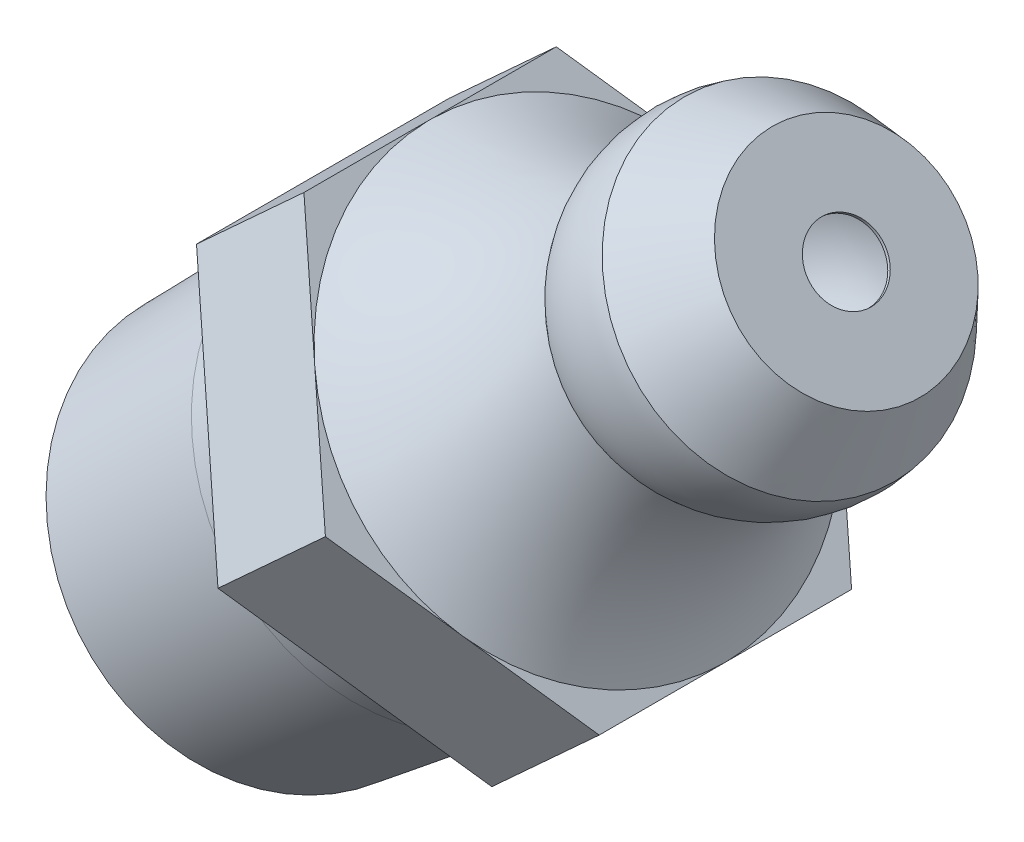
ISO-10303-21;
HEADER;
FILE_DESCRIPTION(('STEP AP214'),'2;1');
FILE_NAME('part.step','',(''),(''),'','','');
FILE_SCHEMA(('AUTOMOTIVE_DESIGN { 1 0 10303 214 1 1 1 1 }'));
ENDSEC;
DATA;
#1=APPLICATION_CONTEXT('core data for automotive mechanical design processes');
#2=APPLICATION_PROTOCOL_DEFINITION('international standard','automotive_design',2000,#1);
#3=PRODUCT_CONTEXT('',#1,'mechanical');
#4=PRODUCT('Part','Part','',(#3));
#5=PRODUCT_RELATED_PRODUCT_CATEGORY('part','',(#4));
#6=PRODUCT_DEFINITION_FORMATION('','',#4);
#7=PRODUCT_DEFINITION_CONTEXT('part definition',#1,'design');
#8=PRODUCT_DEFINITION('design','',#6,#7);
#9=PRODUCT_DEFINITION_SHAPE('','',#8);
#10=(LENGTH_UNIT() NAMED_UNIT(*) SI_UNIT(.MILLI.,.METRE.));
#11=(NAMED_UNIT(*) PLANE_ANGLE_UNIT() SI_UNIT($,.RADIAN.));
#12=(NAMED_UNIT(*) SI_UNIT($,.STERADIAN.) SOLID_ANGLE_UNIT());
#13=UNCERTAINTY_MEASURE_WITH_UNIT(LENGTH_MEASURE(1.E-05),#10,'distance_accuracy_value','');
#14=(GEOMETRIC_REPRESENTATION_CONTEXT(3) GLOBAL_UNCERTAINTY_ASSIGNED_CONTEXT((#13)) GLOBAL_UNIT_ASSIGNED_CONTEXT((#10,
#11,#12)) REPRESENTATION_CONTEXT('',''));
#15=CARTESIAN_POINT('',(0.,0.,0.));
#16=DIRECTION('',(0.,0.,1.));
#17=DIRECTION('',(1.,0.,0.));
#18=AXIS2_PLACEMENT_3D('',#15,#16,#17);
#19=CARTESIAN_POINT('',(136.211987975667,124.815286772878,-234.000002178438));
#20=DIRECTION('',(0.737277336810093,0.675590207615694,-1.17912735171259E-08));
#21=DIRECTION('',(0.675590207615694,-0.737277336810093,1.28679170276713E-08));
#22=AXIS2_PLACEMENT_3D('',#19,#20,#21);
#23=CONICAL_SURFACE('',#22,4.015,0.0599281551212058);
#24=CARTESIAN_POINT('',(137.87086198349,126.335364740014,-234.000002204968));
#25=DIRECTION('',(-0.737277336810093,-0.675590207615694,1.17912735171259E-08));
#26=DIRECTION('',(0.675590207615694,-0.737277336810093,1.28679170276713E-08));
#27=AXIS2_PLACEMENT_3D('',#24,#25,#26);
#28=CIRCLE('',#27,4.15);
#29=CARTESIAN_POINT('',(140.674561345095,123.275663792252,-234.000002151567));
#30=VERTEX_POINT('',#29);
#31=EDGE_CURVE('E11',#30,#30,#28,.T.);
#32=ORIENTED_EDGE('',*,*,#31,.T.);
#33=EDGE_LOOP('',(#32));
#34=FACE_BOUND('',#33,.T.);
#35=CARTESIAN_POINT('',(134.553113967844,123.295208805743,-234.000002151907));
#36=DIRECTION('',(0.737277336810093,0.675590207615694,-1.17912735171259E-08));
#37=DIRECTION('',(0.675590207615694,-0.737277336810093,1.28679170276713E-08));
#38=AXIS2_PLACEMENT_3D('',#35,#36,#37);
#39=CIRCLE('',#38,3.88);
#40=CARTESIAN_POINT('',(131.931823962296,126.155844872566,-234.000002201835));
#41=VERTEX_POINT('',#40);
#42=EDGE_CURVE('E27',#41,#41,#39,.T.);
#43=ORIENTED_EDGE('',*,*,#42,.T.);
#44=EDGE_LOOP('',(#43));
#45=FACE_BOUND('',#44,.T.);
#46=ADVANCED_FACE('F17',(#34,#45),#23,.T.);
#47=CARTESIAN_POINT('',(133.421061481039,122.25787382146,-234.000002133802));
#48=DIRECTION('',(0.737277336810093,0.675590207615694,-1.17912735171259E-08));
#49=DIRECTION('',(0.675590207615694,-0.737277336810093,1.28679170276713E-08));
#50=AXIS2_PLACEMENT_3D('',#47,#48,#49);
#51=CYLINDRICAL_SURFACE('',#50,4.15);
#52=ORIENTED_EDGE('',*,*,#31,.F.);
#53=EDGE_LOOP('',(#52));
#54=FACE_BOUND('',#53,.T.);
#55=CARTESIAN_POINT('',(138.6081393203,127.01095494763,-234.000002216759));
#56=DIRECTION('',(-0.737277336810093,-0.675590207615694,1.17912735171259E-08));
#57=DIRECTION('',(0.675590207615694,-0.737277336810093,1.28679170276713E-08));
#58=AXIS2_PLACEMENT_3D('',#55,#56,#57);
#59=CIRCLE('',#58,4.15);
#60=CARTESIAN_POINT('',(135.804439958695,130.070655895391,-234.000002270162));
#61=VERTEX_POINT('',#60);
#62=EDGE_CURVE('E340',#61,#61,#59,.T.);
#63=ORIENTED_EDGE('',*,*,#62,.T.);
#64=EDGE_LOOP('',(#63));
#65=FACE_BOUND('',#64,.T.);
#66=ADVANCED_FACE('F373',(#54,#65),#51,.T.);
#67=CARTESIAN_POINT('',(138.6081393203,127.01095494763,-234.000002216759));
#68=DIRECTION('',(0.737277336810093,0.675590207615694,-1.17912735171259E-08));
#69=DIRECTION('',(0.675590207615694,-0.737277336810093,1.28679170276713E-08));
#70=AXIS2_PLACEMENT_3D('',#67,#68,#69);
#71=PLANE('',#70);
#72=DIRECTION('',(0.585078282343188,-0.638500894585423,0.50000001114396));
#73=VECTOR('',#72,1.);
#74=CARTESIAN_POINT('',(136.328022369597,129.499266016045,-230.752406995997));
#75=LINE('',#74,#73);
#76=CARTESIAN_POINT('',(135.567983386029,130.32870300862,-231.401926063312));
#77=VERTEX_POINT('',#76);
#78=CARTESIAN_POINT('',(138.6081393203,127.010955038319,-228.803849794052));
#79=VERTEX_POINT('',#78);
#80=EDGE_CURVE('E169',#77,#79,#75,.T.);
#81=ORIENTED_EDGE('',*,*,#80,.F.);
#82=DIRECTION('',(0.,1.74532925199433E-08,1.));
#83=VECTOR('',#82,1.);
#84=CARTESIAN_POINT('',(135.567983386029,130.328702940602,-235.299040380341));
#85=LINE('',#84,#83);
#86=CARTESIAN_POINT('',(135.567983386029,130.32870291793,-236.598078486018));
#87=VERTEX_POINT('',#86);
#88=EDGE_CURVE('E167',#87,#77,#85,.T.);
#89=ORIENTED_EDGE('',*,*,#88,.F.);
#90=DIRECTION('',(-0.585078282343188,0.638500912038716,0.499999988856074));
#91=VECTOR('',#90,1.);
#92=CARTESIAN_POINT('',(137.848100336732,127.840391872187,-238.546635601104));
#93=LINE('',#92,#91);
#94=CARTESIAN_POINT('',(138.6081393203,127.01095485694,-239.196154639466));
#95=VERTEX_POINT('',#94);
#96=EDGE_CURVE('E196',#95,#87,#93,.T.);
#97=ORIENTED_EDGE('',*,*,#96,.F.);
#98=DIRECTION('',(-0.585078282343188,0.638500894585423,-0.50000001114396));
#99=VECTOR('',#98,1.);
#100=CARTESIAN_POINT('',(140.888256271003,124.522643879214,-237.247597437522));
#101=LINE('',#100,#99);
#102=CARTESIAN_POINT('',(141.648295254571,123.693206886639,-236.598078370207));
#103=VERTEX_POINT('',#102);
#104=EDGE_CURVE('E223',#103,#95,#101,.T.);
#105=ORIENTED_EDGE('',*,*,#104,.F.);
#106=DIRECTION('',(0.,-1.74532925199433E-08,-1.));
#107=VECTOR('',#106,1.);
#108=CARTESIAN_POINT('',(141.648295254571,123.693206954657,-232.700964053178));
#109=LINE('',#108,#107);
#110=CARTESIAN_POINT('',(141.648295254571,123.693206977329,-231.4019259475));
#111=VERTEX_POINT('',#110);
#112=EDGE_CURVE('E261',#111,#103,#109,.T.);
#113=ORIENTED_EDGE('',*,*,#112,.F.);
#114=DIRECTION('',(0.585078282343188,-0.638500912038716,-0.499999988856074));
#115=VECTOR('',#114,1.);
#116=CARTESIAN_POINT('',(139.368178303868,126.181518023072,-229.453368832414));
#117=LINE('',#116,#115);
#118=EDGE_CURVE('E311',#79,#111,#117,.T.);
#119=ORIENTED_EDGE('',*,*,#118,.F.);
#120=EDGE_LOOP('',(#81,#89,#97,#105,#113,#119));
#121=FACE_BOUND('',#120,.T.);
#122=ORIENTED_EDGE('',*,*,#62,.F.);
#123=EDGE_LOOP('',(#122));
#124=FACE_BOUND('',#123,.T.);
#125=ADVANCED_FACE('F379',(#121,#124),#71,.F.);
#126=CARTESIAN_POINT('',(128.101273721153,117.383186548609,-228.803849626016));
#127=DIRECTION('',(-0.337795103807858,0.368638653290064,-0.866025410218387));
#128=DIRECTION('',(-0.737277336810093,-0.675590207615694,1.17912735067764E-08));
#129=AXIS2_PLACEMENT_3D('',#126,#127,#128);
#130=PLANE('',#129);
#131=DIRECTION('',(0.737277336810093,0.675590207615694,-1.17912735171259E-08));
#132=VECTOR('',#131,1.);
#133=CARTESIAN_POINT('',(131.141429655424,114.065438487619,-231.401925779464));
#134=LINE('',#133,#132);
#135=CARTESIAN_POINT('',(143.860127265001,125.719977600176,-231.401925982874));
#136=VERTEX_POINT('',#135);
#137=EDGE_CURVE('E306',#111,#136,#134,.T.);
#138=ORIENTED_EDGE('',*,*,#137,.T.);
#139=DIRECTION('',(0.585078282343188,-0.638500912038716,-0.499999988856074));
#140=VECTOR('',#139,1.);
#141=CARTESIAN_POINT('',(141.580010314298,128.208288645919,-229.453368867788));
#142=LINE('',#141,#140);
#143=CARTESIAN_POINT('',(142.362404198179,127.354455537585,-230.121992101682));
#144=VERTEX_POINT('',#143);
#145=EDGE_CURVE('E88',#144,#136,#142,.T.);
#146=ORIENTED_EDGE('',*,*,#145,.F.);
#147=CARTESIAN_POINT('',(143.230065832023,125.900530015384,-231.0793138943));
#148=CARTESIAN_POINT('',(143.112530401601,126.177646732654,-230.915509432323));
#149=CARTESIAN_POINT('',(142.98457435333,126.4478982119,-230.75056269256));
#150=CARTESIAN_POINT('',(142.690945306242,126.947881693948,-230.423205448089));
#151=CARTESIAN_POINT('',(142.524519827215,127.17711749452,-230.260712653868));
#152=CARTESIAN_POINT('',(142.339840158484,127.378659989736,-230.102887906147));
#153=CARTESIAN_POINT('',(142.155160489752,127.580202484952,-229.945063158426));
#154=CARTESIAN_POINT('',(141.941301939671,127.765973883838,-229.782570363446));
#155=CARTESIAN_POINT('',(141.468812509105,128.102062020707,-229.455213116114));
#156=CARTESIAN_POINT('',(141.210741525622,128.253085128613,-229.29026637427));
#157=CARTESIAN_POINT('',(140.944923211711,128.394325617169,-229.126461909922));
#158=(BOUNDED_CURVE() B_SPLINE_CURVE(3,(#147,#148,#149,#150,#151,#152,#153,#154,#155,#156,#157),
.UNSPECIFIED.,.F.,.F.) B_SPLINE_CURVE_WITH_KNOTS((4,2,3,2,4),(-1.89389701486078,
-0.946948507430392,0.,0.946948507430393,1.89389701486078),
.UNSPECIFIED.) CURVE() GEOMETRIC_REPRESENTATION_ITEM() RATIONAL_B_SPLINE_CURVE((1.,1.,1.,1.,1.,
1.,1.,1.,1.,1.,1.)) REPRESENTATION_ITEM(''));
#159=CARTESIAN_POINT('',(142.324514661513,127.395804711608,-230.090056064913));
#160=VERTEX_POINT('',#159);
#161=EDGE_CURVE('E309',#144,#160,#158,.T.);
#162=ORIENTED_EDGE('',*,*,#161,.T.);
#163=DIRECTION('',(0.585078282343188,-0.638500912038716,-0.499999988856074));
#164=VECTOR('',#163,1.);
#165=CARTESIAN_POINT('',(141.580010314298,128.208288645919,-229.453368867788));
#166=LINE('',#165,#164);
#167=CARTESIAN_POINT('',(140.819971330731,129.037725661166,-228.803849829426));
#168=VERTEX_POINT('',#167);
#169=EDGE_CURVE('E99',#168,#160,#166,.T.);
#170=ORIENTED_EDGE('',*,*,#169,.F.);
#171=DIRECTION('',(0.737277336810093,0.675590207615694,-1.17912735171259E-08));
#172=VECTOR('',#171,1.);
#173=CARTESIAN_POINT('',(128.101273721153,117.383186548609,-228.803849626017));
#174=LINE('',#173,#172);
#175=EDGE_CURVE('E286',#79,#168,#174,.T.);
#176=ORIENTED_EDGE('',*,*,#175,.F.);
#177=ORIENTED_EDGE('',*,*,#118,.T.);
#178=EDGE_LOOP('',(#138,#146,#162,#170,#176,#177));
#179=FACE_BOUND('',#178,.T.);
#180=ADVANCED_FACE('F384',(#179),#130,.F.);
#181=CARTESIAN_POINT('',(125.061117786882,120.700934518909,-231.401925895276));
#182=DIRECTION('',(0.337795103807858,-0.368638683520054,-0.866025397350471));
#183=DIRECTION('',(-0.585078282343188,0.638500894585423,-0.50000001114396));
#184=AXIS2_PLACEMENT_3D('',#181,#182,#183);
#185=PLANE('',#184);
#186=ORIENTED_EDGE('',*,*,#175,.T.);
#187=DIRECTION('',(0.585078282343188,-0.638500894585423,0.50000001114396));
#188=VECTOR('',#187,1.);
#189=CARTESIAN_POINT('',(138.539854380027,131.526036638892,-230.752407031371));
#190=LINE('',#189,#188);
#191=CARTESIAN_POINT('',(139.316091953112,130.678381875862,-230.088814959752));
#192=VERTEX_POINT('',#191);
#193=EDGE_CURVE('E298',#192,#168,#190,.T.);
#194=ORIENTED_EDGE('',*,*,#193,.F.);
#195=CARTESIAN_POINT('',(140.189909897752,129.218278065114,-229.126461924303));
#196=CARTESIAN_POINT('',(140.07237446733,129.495394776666,-229.290266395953));
#197=CARTESIAN_POINT('',(139.94441841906,129.765646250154,-229.45521314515));
#198=CARTESIAN_POINT('',(139.650789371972,130.265629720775,-229.782570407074));
#199=CARTESIAN_POINT('',(139.484363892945,130.494865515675,-229.945063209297));
#200=CARTESIAN_POINT('',(139.299684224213,130.696408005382,-230.102887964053));
#201=CARTESIAN_POINT('',(139.115004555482,130.897950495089,-230.260712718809));
#202=CARTESIAN_POINT('',(138.901146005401,131.083721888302,-230.423205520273));
#203=CARTESIAN_POINT('',(138.428656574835,131.419810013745,-230.750562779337));
#204=CARTESIAN_POINT('',(138.170585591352,131.570833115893,-230.915509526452));
#205=CARTESIAN_POINT('',(137.904767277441,131.712073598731,-231.079313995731));
#206=(BOUNDED_CURVE() B_SPLINE_CURVE(3,(#195,#196,#197,#198,#199,#200,#201,#202,#203,#204,#205),
.UNSPECIFIED.,.F.,.F.) B_SPLINE_CURVE_WITH_KNOTS((4,2,3,2,4),(-1.89389701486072,
-0.946948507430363,0.,0.946948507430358,1.89389701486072),
.UNSPECIFIED.) CURVE() GEOMETRIC_REPRESENTATION_ITEM() RATIONAL_B_SPLINE_CURVE((1.,1.,1.,1.,1.,
1.,1.,1.,1.,1.,1.)) REPRESENTATION_ITEM(''));
#207=CARTESIAN_POINT('',(139.28064587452,130.717025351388,-230.119090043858));
#208=VERTEX_POINT('',#207);
#209=EDGE_CURVE('E284',#192,#208,#206,.T.);
#210=ORIENTED_EDGE('',*,*,#209,.T.);
#211=DIRECTION('',(0.585078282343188,-0.638500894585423,0.50000001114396));
#212=VECTOR('',#211,1.);
#213=CARTESIAN_POINT('',(138.539854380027,131.526036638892,-230.752407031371));
#214=LINE('',#213,#212);
#215=CARTESIAN_POINT('',(137.77981539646,132.355473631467,-231.401926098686));
#216=VERTEX_POINT('',#215);
#217=EDGE_CURVE('E158',#216,#208,#214,.T.);
#218=ORIENTED_EDGE('',*,*,#217,.F.);
#219=DIRECTION('',(0.737277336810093,0.675590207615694,-1.17912735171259E-08));
#220=VECTOR('',#219,1.);
#221=CARTESIAN_POINT('',(125.061117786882,120.700934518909,-231.401925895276));
#222=LINE('',#221,#220);
#223=EDGE_CURVE('E166',#77,#216,#222,.T.);
#224=ORIENTED_EDGE('',*,*,#223,.F.);
#225=ORIENTED_EDGE('',*,*,#80,.T.);
#226=EDGE_LOOP('',(#186,#194,#210,#218,#224,#225));
#227=FACE_BOUND('',#226,.T.);
#228=ADVANCED_FACE('F404',(#227),#185,.F.);
#229=CARTESIAN_POINT('',(125.061117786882,120.700934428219,-236.598078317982));
#230=DIRECTION('',(0.675590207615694,-0.737277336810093,1.28679170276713E-08));
#231=DIRECTION('',(0.737277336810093,0.675590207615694,-1.17912735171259E-08));
#232=AXIS2_PLACEMENT_3D('',#229,#230,#231);
#233=PLANE('',#232);
#234=ORIENTED_EDGE('',*,*,#223,.T.);
#235=DIRECTION('',(0.,1.74532925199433E-08,1.));
#236=VECTOR('',#235,1.);
#237=CARTESIAN_POINT('',(137.77981539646,132.35547356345,-235.299040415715));
#238=LINE('',#237,#236);
#239=CARTESIAN_POINT('',(137.779501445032,132.355185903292,-233.962767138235));
#240=VERTEX_POINT('',#239);
#241=EDGE_CURVE('E154',#240,#216,#238,.T.);
#242=ORIENTED_EDGE('',*,*,#241,.F.);
#243=CARTESIAN_POINT('',(137.527260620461,132.124049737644,-235.952854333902));
#244=CARTESIAN_POINT('',(137.601402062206,132.191987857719,-235.625245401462));
#245=CARTESIAN_POINT('',(137.666459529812,132.251602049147,-235.295351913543));
#246=CARTESIAN_POINT('',(137.755889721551,132.333549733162,-234.640637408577));
#247=CARTESIAN_POINT('',(137.779606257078,132.355281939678,-234.315651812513));
#248=CARTESIAN_POINT('',(137.779606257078,132.355281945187,-234.000002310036));
#249=CARTESIAN_POINT('',(137.779606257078,132.355281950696,-233.684352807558));
#250=CARTESIAN_POINT('',(137.755889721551,132.333549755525,-233.359367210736));
#251=CARTESIAN_POINT('',(137.666459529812,132.251602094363,-232.70465270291));
#252=CARTESIAN_POINT('',(137.601402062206,132.19198791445,-232.374759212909));
#253=CARTESIAN_POINT('',(137.527260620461,132.124049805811,-232.047150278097));
#254=(BOUNDED_CURVE() B_SPLINE_CURVE(3,(#243,#244,#245,#246,#247,#248,#249,#250,#251,#252,#253),
.UNSPECIFIED.,.F.,.F.) B_SPLINE_CURVE_WITH_KNOTS((4,2,3,2,4),(-1.89389701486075,
-0.946948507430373,0.,0.946948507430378,1.89389701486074),
.UNSPECIFIED.) CURVE() GEOMETRIC_REPRESENTATION_ITEM() RATIONAL_B_SPLINE_CURVE((1.,1.,1.,1.,1.,
1.,1.,1.,1.,1.,1.)) REPRESENTATION_ITEM(''));
#255=CARTESIAN_POINT('',(137.779606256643,132.355281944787,-234.000078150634));
#256=VERTEX_POINT('',#255);
#257=EDGE_CURVE('E146',#256,#240,#254,.T.);
#258=ORIENTED_EDGE('',*,*,#257,.F.);
#259=CARTESIAN_POINT('',(137.527260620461,132.124049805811,-232.047150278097));
#260=CARTESIAN_POINT('',(137.601402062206,132.19198791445,-232.374759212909));
#261=CARTESIAN_POINT('',(137.666459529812,132.251602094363,-232.70465270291));
#262=CARTESIAN_POINT('',(137.755889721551,132.333549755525,-233.359367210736));
#263=CARTESIAN_POINT('',(137.779606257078,132.355281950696,-233.684352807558));
#264=CARTESIAN_POINT('',(137.779606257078,132.355281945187,-234.000002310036));
#265=CARTESIAN_POINT('',(137.779606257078,132.355281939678,-234.315651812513));
#266=CARTESIAN_POINT('',(137.755889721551,132.333549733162,-234.640637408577));
#267=CARTESIAN_POINT('',(137.666459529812,132.251602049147,-235.295351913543));
#268=CARTESIAN_POINT('',(137.601402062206,132.191987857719,-235.625245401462));
#269=CARTESIAN_POINT('',(137.527260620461,132.124049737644,-235.952854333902));
#270=(BOUNDED_CURVE() B_SPLINE_CURVE(3,(#259,#260,#261,#262,#263,#264,#265,#266,#267,#268,#269),
.UNSPECIFIED.,.F.,.F.) B_SPLINE_CURVE_WITH_KNOTS((4,2,3,2,4),(-1.89389701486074,
-0.946948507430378,0.,0.946948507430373,1.89389701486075),
.UNSPECIFIED.) CURVE() GEOMETRIC_REPRESENTATION_ITEM() RATIONAL_B_SPLINE_CURVE((1.,1.,1.,1.,1.,
1.,1.,1.,1.,1.,1.)) REPRESENTATION_ITEM(''));
#271=CARTESIAN_POINT('',(137.780127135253,132.355133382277,-234.03723940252));
#272=VERTEX_POINT('',#271);
#273=EDGE_CURVE('E151',#256,#272,#270,.T.);
#274=ORIENTED_EDGE('',*,*,#273,.T.);
#275=DIRECTION('',(0.,1.74532925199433E-08,1.));
#276=VECTOR('',#275,1.);
#277=CARTESIAN_POINT('',(137.77981539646,132.35547356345,-235.299040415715));
#278=LINE('',#277,#276);
#279=CARTESIAN_POINT('',(137.77981539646,132.355473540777,-236.598078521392));
#280=VERTEX_POINT('',#279);
#281=EDGE_CURVE('E212',#280,#272,#278,.T.);
#282=ORIENTED_EDGE('',*,*,#281,.F.);
#283=DIRECTION('',(0.737277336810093,0.675590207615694,-1.17912735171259E-08));
#284=VECTOR('',#283,1.);
#285=CARTESIAN_POINT('',(125.061117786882,120.700934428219,-236.598078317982));
#286=LINE('',#285,#284);
#287=EDGE_CURVE('E171',#87,#280,#286,.T.);
#288=ORIENTED_EDGE('',*,*,#287,.F.);
#289=ORIENTED_EDGE('',*,*,#88,.T.);
#290=EDGE_LOOP('',(#234,#242,#258,#274,#282,#288,#289));
#291=FACE_BOUND('',#290,.T.);
#292=ADVANCED_FACE('F149',(#291),#233,.F.);
#293=CARTESIAN_POINT('',(128.101273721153,117.383186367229,-239.19615447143));
#294=DIRECTION('',(0.337795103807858,-0.368638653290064,0.866025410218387));
#295=DIRECTION('',(0.737277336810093,0.675590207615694,-1.17912735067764E-08));
#296=AXIS2_PLACEMENT_3D('',#293,#294,#295);
#297=PLANE('',#296);
#298=ORIENTED_EDGE('',*,*,#287,.T.);
#299=DIRECTION('',(-0.585078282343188,0.638500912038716,0.499999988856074));
#300=VECTOR('',#299,1.);
#301=CARTESIAN_POINT('',(140.059932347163,129.867162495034,-238.546635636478));
#302=LINE('',#301,#300);
#303=CARTESIAN_POINT('',(139.277219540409,130.720702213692,-237.878012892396));
#304=VERTEX_POINT('',#303);
#305=EDGE_CURVE('E186',#304,#280,#302,.T.);
#306=ORIENTED_EDGE('',*,*,#305,.F.);
#307=CARTESIAN_POINT('',(137.90476727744,131.71207349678,-236.920690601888));
#308=CARTESIAN_POINT('',(138.170585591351,131.570833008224,-237.084495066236));
#309=CARTESIAN_POINT('',(138.428656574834,131.419809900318,-237.24944180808));
#310=CARTESIAN_POINT('',(138.901146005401,131.083721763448,-237.576799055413));
#311=CARTESIAN_POINT('',(139.115004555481,130.897950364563,-237.739291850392));
#312=CARTESIAN_POINT('',(139.299684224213,130.696407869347,-237.897116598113));
#313=CARTESIAN_POINT('',(139.484363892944,130.494865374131,-238.054941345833));
#314=CARTESIAN_POINT('',(139.650789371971,130.265629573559,-238.217434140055));
#315=CARTESIAN_POINT('',(139.944418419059,129.765646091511,-238.544791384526));
#316=CARTESIAN_POINT('',(140.07237446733,129.495394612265,-238.709738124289));
#317=CARTESIAN_POINT('',(140.189909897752,129.218277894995,-238.873542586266));
#318=(BOUNDED_CURVE() B_SPLINE_CURVE(3,(#307,#308,#309,#310,#311,#312,#313,#314,#315,#316,#317),
.UNSPECIFIED.,.F.,.F.) B_SPLINE_CURVE_WITH_KNOTS((4,2,3,2,4),(-1.89389701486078,
-0.946948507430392,0.,0.946948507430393,1.89389701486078),
.UNSPECIFIED.) CURVE() GEOMETRIC_REPRESENTATION_ITEM() RATIONAL_B_SPLINE_CURVE((1.,1.,1.,1.,1.,
1.,1.,1.,1.,1.,1.)) REPRESENTATION_ITEM(''));
#319=CARTESIAN_POINT('',(139.3160930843,130.678380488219,-237.911190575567));
#320=VERTEX_POINT('',#319);
#321=EDGE_CURVE('E193',#304,#320,#318,.T.);
#322=ORIENTED_EDGE('',*,*,#321,.T.);
#323=DIRECTION('',(-0.585078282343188,0.638500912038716,0.499999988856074));
#324=VECTOR('',#323,1.);
#325=CARTESIAN_POINT('',(140.059932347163,129.867162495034,-238.546635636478));
#326=LINE('',#325,#324);
#327=CARTESIAN_POINT('',(140.81997133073,129.037725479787,-239.19615467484));
#328=VERTEX_POINT('',#327);
#329=EDGE_CURVE('E185',#328,#320,#326,.T.);
#330=ORIENTED_EDGE('',*,*,#329,.F.);
#331=DIRECTION('',(0.737277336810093,0.675590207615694,-1.17912735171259E-08));
#332=VECTOR('',#331,1.);
#333=CARTESIAN_POINT('',(128.101273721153,117.383186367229,-239.19615447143));
#334=LINE('',#333,#332);
#335=EDGE_CURVE('E222',#95,#328,#334,.T.);
#336=ORIENTED_EDGE('',*,*,#335,.F.);
#337=ORIENTED_EDGE('',*,*,#96,.T.);
#338=EDGE_LOOP('',(#298,#306,#322,#330,#336,#337));
#339=FACE_BOUND('',#338,.T.);
#340=ADVANCED_FACE('F351',(#339),#297,.F.);
#341=CARTESIAN_POINT('',(131.141429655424,114.065438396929,-236.59807820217));
#342=DIRECTION('',(-0.337795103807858,0.368638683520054,0.86602539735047));
#343=DIRECTION('',(0.737277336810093,0.675590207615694,-1.17912735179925E-08));
#344=AXIS2_PLACEMENT_3D('',#341,#342,#343);
#345=PLANE('',#344);
#346=ORIENTED_EDGE('',*,*,#335,.T.);
#347=DIRECTION('',(-0.585078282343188,0.638500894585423,-0.50000001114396));
#348=VECTOR('',#347,1.);
#349=CARTESIAN_POINT('',(143.100088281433,126.549414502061,-237.247597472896));
#350=LINE('',#349,#348);
#351=CARTESIAN_POINT('',(142.323581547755,127.39682289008,-237.91118965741));
#352=VERTEX_POINT('',#351);
#353=EDGE_CURVE('E190',#352,#328,#350,.T.);
#354=ORIENTED_EDGE('',*,*,#353,.F.);
#355=CARTESIAN_POINT('',(140.944923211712,128.394325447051,-238.873542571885));
#356=CARTESIAN_POINT('',(141.210741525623,128.253084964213,-238.709738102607));
#357=CARTESIAN_POINT('',(141.468812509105,128.102061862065,-238.544791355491));
#358=CARTESIAN_POINT('',(141.941301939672,127.765973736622,-238.217434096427));
#359=CARTESIAN_POINT('',(142.155160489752,127.580202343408,-238.054941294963));
#360=CARTESIAN_POINT('',(142.339840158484,127.378659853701,-237.897116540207));
#361=CARTESIAN_POINT('',(142.524519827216,127.177117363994,-237.739291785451));
#362=CARTESIAN_POINT('',(142.690945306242,126.947881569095,-237.576798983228));
#363=CARTESIAN_POINT('',(142.98457435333,126.447898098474,-237.249441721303));
#364=CARTESIAN_POINT('',(143.112530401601,126.177646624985,-237.084494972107));
#365=CARTESIAN_POINT('',(143.230065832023,125.900529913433,-236.920690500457));
#366=(BOUNDED_CURVE() B_SPLINE_CURVE(3,(#355,#356,#357,#358,#359,#360,#361,#362,#363,#364,#365),
.UNSPECIFIED.,.F.,.F.) B_SPLINE_CURVE_WITH_KNOTS((4,2,3,2,4),(-1.89389701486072,
-0.946948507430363,0.,0.946948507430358,1.89389701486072),
.UNSPECIFIED.) CURVE() GEOMETRIC_REPRESENTATION_ITEM() RATIONAL_B_SPLINE_CURVE((1.,1.,1.,1.,1.,
1.,1.,1.,1.,1.,1.)) REPRESENTATION_ITEM(''));
#367=CARTESIAN_POINT('',(142.36245675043,127.353749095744,-237.877691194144));
#368=VERTEX_POINT('',#367);
#369=EDGE_CURVE('E219',#352,#368,#366,.T.);
#370=ORIENTED_EDGE('',*,*,#369,.T.);
#371=DIRECTION('',(-0.585078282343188,0.638500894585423,-0.50000001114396));
#372=VECTOR('',#371,1.);
#373=CARTESIAN_POINT('',(143.100088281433,126.549414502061,-237.247597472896));
#374=LINE('',#373,#372);
#375=CARTESIAN_POINT('',(143.860127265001,125.719977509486,-236.598078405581));
#376=VERTEX_POINT('',#375);
#377=EDGE_CURVE('E207',#376,#368,#374,.T.);
#378=ORIENTED_EDGE('',*,*,#377,.F.);
#379=DIRECTION('',(0.737277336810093,0.675590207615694,-1.17912735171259E-08));
#380=VECTOR('',#379,1.);
#381=CARTESIAN_POINT('',(131.141429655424,114.065438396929,-236.59807820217));
#382=LINE('',#381,#380);
#383=EDGE_CURVE('E247',#103,#376,#382,.T.);
#384=ORIENTED_EDGE('',*,*,#383,.F.);
#385=ORIENTED_EDGE('',*,*,#104,.T.);
#386=EDGE_LOOP('',(#346,#354,#370,#378,#384,#385));
#387=FACE_BOUND('',#386,.T.);
#388=ADVANCED_FACE('F386',(#387),#345,.F.);
#389=CARTESIAN_POINT('',(131.141429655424,114.065438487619,-231.401925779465));
#390=DIRECTION('',(-0.675590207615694,0.737277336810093,-1.28679170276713E-08));
#391=DIRECTION('',(0.,1.74532925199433E-08,1.));
#392=AXIS2_PLACEMENT_3D('',#389,#390,#391);
#393=PLANE('',#392);
#394=ORIENTED_EDGE('',*,*,#383,.T.);
#395=DIRECTION('',(0.,-1.74532925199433E-08,-1.));
#396=VECTOR('',#395,1.);
#397=CARTESIAN_POINT('',(143.860127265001,125.719977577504,-232.700964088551));
#398=LINE('',#397,#396);
#399=CARTESIAN_POINT('',(143.860127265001,125.719977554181,-234.037240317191));
#400=VERTEX_POINT('',#399);
#401=EDGE_CURVE('E216',#400,#376,#398,.T.);
#402=ORIENTED_EDGE('',*,*,#401,.F.);
#403=CARTESIAN_POINT('',(143.607572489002,125.488553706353,-235.952854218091));
#404=CARTESIAN_POINT('',(143.681713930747,125.556491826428,-235.62524528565));
#405=CARTESIAN_POINT('',(143.746771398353,125.616106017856,-235.295351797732));
#406=CARTESIAN_POINT('',(143.836201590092,125.698053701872,-234.640637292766));
#407=CARTESIAN_POINT('',(143.859918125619,125.719785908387,-234.315651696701));
#408=CARTESIAN_POINT('',(143.859918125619,125.719785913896,-234.000002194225));
#409=CARTESIAN_POINT('',(143.859918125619,125.719785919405,-233.684352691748));
#410=CARTESIAN_POINT('',(143.836201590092,125.698053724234,-233.359367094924));
#411=CARTESIAN_POINT('',(143.746771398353,125.616106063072,-232.704652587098));
#412=CARTESIAN_POINT('',(143.681713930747,125.55649188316,-232.374759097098));
#413=CARTESIAN_POINT('',(143.607572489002,125.48855377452,-232.047150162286));
#414=(BOUNDED_CURVE() B_SPLINE_CURVE(3,(#403,#404,#405,#406,#407,#408,#409,#410,#411,#412,#413),
.UNSPECIFIED.,.F.,.F.) B_SPLINE_CURVE_WITH_KNOTS((4,2,3,2,4),(-1.89389701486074,
-0.946948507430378,0.,0.946948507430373,1.89389701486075),
.UNSPECIFIED.) CURVE() GEOMETRIC_REPRESENTATION_ITEM() RATIONAL_B_SPLINE_CURVE((1.,1.,1.,1.,1.,
1.,1.,1.,1.,1.,1.)) REPRESENTATION_ITEM(''));
#415=CARTESIAN_POINT('',(143.85991812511,125.719785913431,-233.999920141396));
#416=VERTEX_POINT('',#415);
#417=EDGE_CURVE('E245',#400,#416,#414,.T.);
#418=ORIENTED_EDGE('',*,*,#417,.T.);
#419=CARTESIAN_POINT('',(143.607572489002,125.488553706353,-235.952854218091));
#420=CARTESIAN_POINT('',(143.681713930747,125.556491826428,-235.62524528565));
#421=CARTESIAN_POINT('',(143.746771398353,125.616106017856,-235.295351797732));
#422=CARTESIAN_POINT('',(143.836201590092,125.698053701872,-234.640637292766));
#423=CARTESIAN_POINT('',(143.859918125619,125.719785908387,-234.315651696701));
#424=CARTESIAN_POINT('',(143.859918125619,125.719785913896,-234.000002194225));
#425=CARTESIAN_POINT('',(143.859918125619,125.719785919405,-233.684352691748));
#426=CARTESIAN_POINT('',(143.836201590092,125.698053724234,-233.359367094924));
#427=CARTESIAN_POINT('',(143.746771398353,125.616106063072,-232.704652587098));
#428=CARTESIAN_POINT('',(143.681713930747,125.55649188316,-232.374759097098));
#429=CARTESIAN_POINT('',(143.607572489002,125.48855377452,-232.047150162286));
#430=(BOUNDED_CURVE() B_SPLINE_CURVE(3,(#419,#420,#421,#422,#423,#424,#425,#426,#427,#428,#429),
.UNSPECIFIED.,.F.,.F.) B_SPLINE_CURVE_WITH_KNOTS((4,2,3,2,4),(-1.89389701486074,
-0.946948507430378,0.,0.946948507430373,1.89389701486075),
.UNSPECIFIED.) CURVE() GEOMETRIC_REPRESENTATION_ITEM() RATIONAL_B_SPLINE_CURVE((1.,1.,1.,1.,1.,
1.,1.,1.,1.,1.,1.)) REPRESENTATION_ITEM(''));
#431=CARTESIAN_POINT('',(143.859813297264,125.719689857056,-233.962764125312));
#432=VERTEX_POINT('',#431);
#433=EDGE_CURVE('E248',#416,#432,#430,.T.);
#434=ORIENTED_EDGE('',*,*,#433,.T.);
#435=DIRECTION('',(0.,-1.74532925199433E-08,-1.));
#436=VECTOR('',#435,1.);
#437=CARTESIAN_POINT('',(143.860127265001,125.719977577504,-232.700964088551));
#438=LINE('',#437,#436);
#439=EDGE_CURVE('E234',#136,#432,#438,.T.);
#440=ORIENTED_EDGE('',*,*,#439,.F.);
#441=ORIENTED_EDGE('',*,*,#137,.F.);
#442=ORIENTED_EDGE('',*,*,#112,.T.);
#443=EDGE_LOOP('',(#394,#402,#418,#434,#440,#441,#442));
#444=FACE_BOUND('',#443,.T.);
#445=ADVANCED_FACE('F388',(#444),#393,.F.);
#446=CARTESIAN_POINT('',(140.81997133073,129.037725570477,-234.000002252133));
#447=DIRECTION('',(0.737277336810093,0.675590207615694,-1.17912735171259E-08));
#448=DIRECTION('',(0.675590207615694,-0.737277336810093,1.28679170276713E-08));
#449=AXIS2_PLACEMENT_3D('',#446,#447,#448);
#450=PLANE('',#449);
#451=CARTESIAN_POINT('',(140.81997133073,129.037725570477,-234.000002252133));
#452=DIRECTION('',(0.737277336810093,0.675590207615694,-1.17912735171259E-08));
#453=DIRECTION('',(0.,-1.74532925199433E-08,-1.));
#454=AXIS2_PLACEMENT_3D('',#451,#452,#453);
#455=CIRCLE('',#454,4.49969264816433);
#456=EDGE_CURVE('E295',#192,#160,#455,.T.);
#457=ORIENTED_EDGE('',*,*,#456,.F.);
#458=ORIENTED_EDGE('',*,*,#193,.T.);
#459=ORIENTED_EDGE('',*,*,#169,.T.);
#460=EDGE_LOOP('',(#457,#458,#459));
#461=FACE_BOUND('',#460,.T.);
#462=ADVANCED_FACE('F390',(#461),#450,.T.);
#463=CARTESIAN_POINT('',(140.81997133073,129.037725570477,-234.000002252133));
#464=DIRECTION('',(0.737277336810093,0.675590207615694,-1.17912735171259E-08));
#465=DIRECTION('',(0.675590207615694,-0.737277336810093,1.28679170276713E-08));
#466=AXIS2_PLACEMENT_3D('',#463,#464,#465);
#467=PLANE('',#466);
#468=CARTESIAN_POINT('',(140.81997133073,129.037725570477,-234.000002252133));
#469=DIRECTION('',(0.737277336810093,0.675590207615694,-1.17912735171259E-08));
#470=DIRECTION('',(0.,-1.74532925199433E-08,-1.));
#471=AXIS2_PLACEMENT_3D('',#468,#469,#470);
#472=CIRCLE('',#471,4.49969264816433);
#473=EDGE_CURVE('E321',#144,#432,#472,.T.);
#474=ORIENTED_EDGE('',*,*,#473,.F.);
#475=ORIENTED_EDGE('',*,*,#145,.T.);
#476=ORIENTED_EDGE('',*,*,#439,.T.);
#477=EDGE_LOOP('',(#474,#475,#476));
#478=FACE_BOUND('',#477,.T.);
#479=ADVANCED_FACE('F392',(#478),#467,.T.);
#480=CARTESIAN_POINT('',(140.81997133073,129.037725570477,-234.000002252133));
#481=DIRECTION('',(0.737277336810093,0.675590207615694,-1.17912735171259E-08));
#482=DIRECTION('',(0.675590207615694,-0.737277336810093,1.28679170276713E-08));
#483=AXIS2_PLACEMENT_3D('',#480,#481,#482);
#484=PLANE('',#483);
#485=CARTESIAN_POINT('',(140.81997133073,129.037725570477,-234.000002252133));
#486=DIRECTION('',(-0.737277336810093,-0.675590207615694,1.17912735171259E-08));
#487=DIRECTION('',(0.,-1.74532925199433E-08,-1.));
#488=AXIS2_PLACEMENT_3D('',#485,#486,#487);
#489=CIRCLE('',#488,4.49969264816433);
#490=EDGE_CURVE('E228',#368,#400,#489,.T.);
#491=ORIENTED_EDGE('',*,*,#490,.T.);
#492=ORIENTED_EDGE('',*,*,#401,.T.);
#493=ORIENTED_EDGE('',*,*,#377,.T.);
#494=EDGE_LOOP('',(#491,#492,#493));
#495=FACE_BOUND('',#494,.T.);
#496=ADVANCED_FACE('F367',(#495),#484,.T.);
#497=CARTESIAN_POINT('',(140.81997133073,129.037725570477,-234.000002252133));
#498=DIRECTION('',(0.737277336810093,0.675590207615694,-1.17912735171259E-08));
#499=DIRECTION('',(0.675590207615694,-0.737277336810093,1.28679170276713E-08));
#500=AXIS2_PLACEMENT_3D('',#497,#498,#499);
#501=PLANE('',#500);
#502=CARTESIAN_POINT('',(140.81997133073,129.037725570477,-234.000002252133));
#503=DIRECTION('',(-0.737277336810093,-0.675590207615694,1.17912735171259E-08));
#504=DIRECTION('',(0.,-1.74532925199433E-08,-1.));
#505=AXIS2_PLACEMENT_3D('',#502,#503,#504);
#506=CIRCLE('',#505,4.49969264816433);
#507=EDGE_CURVE('E201',#320,#352,#506,.T.);
#508=ORIENTED_EDGE('',*,*,#507,.T.);
#509=ORIENTED_EDGE('',*,*,#353,.T.);
#510=ORIENTED_EDGE('',*,*,#329,.T.);
#511=EDGE_LOOP('',(#508,#509,#510));
#512=FACE_BOUND('',#511,.T.);
#513=ADVANCED_FACE('F359',(#512),#501,.T.);
#514=CARTESIAN_POINT('',(140.81997133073,129.037725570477,-234.000002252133));
#515=DIRECTION('',(0.737277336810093,0.675590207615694,-1.17912735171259E-08));
#516=DIRECTION('',(0.675590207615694,-0.737277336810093,1.28679170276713E-08));
#517=AXIS2_PLACEMENT_3D('',#514,#515,#516);
#518=PLANE('',#517);
#519=CARTESIAN_POINT('',(140.81997133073,129.037725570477,-234.000002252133));
#520=DIRECTION('',(-0.737277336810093,-0.675590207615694,1.17912735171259E-08));
#521=DIRECTION('',(0.,-1.74532925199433E-08,-1.));
#522=AXIS2_PLACEMENT_3D('',#519,#520,#521);
#523=CIRCLE('',#522,4.49969264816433);
#524=EDGE_CURVE('E165',#272,#304,#523,.T.);
#525=ORIENTED_EDGE('',*,*,#524,.T.);
#526=ORIENTED_EDGE('',*,*,#305,.T.);
#527=ORIENTED_EDGE('',*,*,#281,.T.);
#528=EDGE_LOOP('',(#525,#526,#527));
#529=FACE_BOUND('',#528,.T.);
#530=ADVANCED_FACE('F356',(#529),#518,.T.);
#531=CARTESIAN_POINT('',(140.81997133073,129.037725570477,-234.000002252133));
#532=DIRECTION('',(0.737277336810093,0.675590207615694,-1.17912735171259E-08));
#533=DIRECTION('',(0.675590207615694,-0.737277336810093,1.28679170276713E-08));
#534=AXIS2_PLACEMENT_3D('',#531,#532,#533);
#535=PLANE('',#534);
#536=CARTESIAN_POINT('',(140.81997133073,129.037725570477,-234.000002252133));
#537=DIRECTION('',(0.737277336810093,0.675590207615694,-1.17912735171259E-08));
#538=DIRECTION('',(0.,-1.74532925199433E-08,-1.));
#539=AXIS2_PLACEMENT_3D('',#536,#537,#538);
#540=CIRCLE('',#539,4.49969264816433);
#541=EDGE_CURVE('E159',#240,#208,#540,.T.);
#542=ORIENTED_EDGE('',*,*,#541,.F.);
#543=ORIENTED_EDGE('',*,*,#241,.T.);
#544=ORIENTED_EDGE('',*,*,#217,.T.);
#545=EDGE_LOOP('',(#542,#543,#544));
#546=FACE_BOUND('',#545,.T.);
#547=ADVANCED_FACE('F358',(#546),#535,.T.);
#548=CARTESIAN_POINT('',(144.070627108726,132.016402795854,-234.000002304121));
#549=DIRECTION('',(0.737277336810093,0.675590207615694,-1.17912735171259E-08));
#550=DIRECTION('',(0.675590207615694,-0.737277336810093,1.28679170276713E-08));
#551=AXIS2_PLACEMENT_3D('',#548,#549,#550);
#552=TOROIDAL_SURFACE('',#551,8.569178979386,6.);
#553=ORIENTED_EDGE('',*,*,#273,.F.);
#554=ORIENTED_EDGE('',*,*,#257,.T.);
#555=ORIENTED_EDGE('',*,*,#541,.T.);
#556=ORIENTED_EDGE('',*,*,#209,.F.);
#557=ORIENTED_EDGE('',*,*,#456,.T.);
#558=ORIENTED_EDGE('',*,*,#161,.F.);
#559=ORIENTED_EDGE('',*,*,#473,.T.);
#560=ORIENTED_EDGE('',*,*,#433,.F.);
#561=ORIENTED_EDGE('',*,*,#417,.F.);
#562=ORIENTED_EDGE('',*,*,#490,.F.);
#563=ORIENTED_EDGE('',*,*,#369,.F.);
#564=ORIENTED_EDGE('',*,*,#507,.F.);
#565=ORIENTED_EDGE('',*,*,#321,.F.);
#566=ORIENTED_EDGE('',*,*,#524,.F.);
#567=EDGE_LOOP('',(#553,#554,#555,#556,#557,#558,#559,#560,#561,#562,#563,#564,#565,#566));
#568=FACE_BOUND('',#567,.T.);
#569=CARTESIAN_POINT('',(143.346997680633,131.353318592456,-234.000002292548));
#570=DIRECTION('',(-0.737277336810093,-0.675590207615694,1.17912735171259E-08));
#571=DIRECTION('',(0.,-1.74532925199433E-08,-1.));
#572=AXIS2_PLACEMENT_3D('',#569,#570,#571);
#573=CIRCLE('',#572,2.65000000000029);
#574=CARTESIAN_POINT('',(141.556683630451,133.307103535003,-234.000002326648));
#575=VERTEX_POINT('',#574);
#576=EDGE_CURVE('E326',#575,#575,#573,.T.);
#577=ORIENTED_EDGE('',*,*,#576,.T.);
#578=EDGE_LOOP('',(#577));
#579=FACE_BOUND('',#578,.T.);
#580=ADVANCED_FACE('F161',(#568,#579),#552,.F.);
#581=CARTESIAN_POINT('',(144.734176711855,132.624433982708,-234.000002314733));
#582=DIRECTION('',(-0.737277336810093,-0.675590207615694,1.17912735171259E-08));
#583=DIRECTION('',(0.,1.74532925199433E-08,1.));
#584=AXIS2_PLACEMENT_3D('',#581,#582,#583);
#585=SPHERICAL_SURFACE('',#584,3.25);
#586=CARTESIAN_POINT('',(145.17654311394,133.029788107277,-234.000002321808));
#587=DIRECTION('',(0.737277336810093,0.675590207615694,-1.17912735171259E-08));
#588=DIRECTION('',(-0.675590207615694,0.737277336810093,-1.28679170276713E-08));
#589=AXIS2_PLACEMENT_3D('',#586,#587,#588);
#590=CIRCLE('',#589,3.19413525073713);
#591=CARTESIAN_POINT('',(147.334469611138,130.674824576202,-234.000002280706));
#592=VERTEX_POINT('',#591);
#593=EDGE_CURVE('E330',#592,#592,#590,.T.);
#594=ORIENTED_EDGE('',*,*,#593,.F.);
#595=EDGE_LOOP('',(#594));
#596=FACE_BOUND('',#595,.T.);
#597=ORIENTED_EDGE('',*,*,#576,.F.);
#598=EDGE_LOOP('',(#597));
#599=FACE_BOUND('',#598,.T.);
#600=ADVANCED_FACE('F524',(#596,#599),#585,.T.);
#601=CARTESIAN_POINT('',(145.763047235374,133.567220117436,-234.000002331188));
#602=DIRECTION('',(-0.737277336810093,-0.675590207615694,1.17912735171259E-08));
#603=DIRECTION('',(-0.675590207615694,0.737277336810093,-1.28679170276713E-08));
#604=AXIS2_PLACEMENT_3D('',#601,#602,#603);
#605=CONICAL_SURFACE('',#604,2.722067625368,0.535569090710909);
#606=ORIENTED_EDGE('',*,*,#593,.T.);
#607=EDGE_LOOP('',(#606));
#608=FACE_BOUND('',#607,.T.);
#609=CARTESIAN_POINT('',(146.349551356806,134.104652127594,-234.000002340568));
#610=DIRECTION('',(-0.737277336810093,-0.675590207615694,1.17912735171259E-08));
#611=DIRECTION('',(-0.675590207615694,0.737277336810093,-1.28679170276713E-08));
#612=AXIS2_PLACEMENT_3D('',#609,#610,#611);
#613=CIRCLE('',#612,2.24999999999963);
#614=CARTESIAN_POINT('',(144.829473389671,135.763526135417,-234.000002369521));
#615=VERTEX_POINT('',#614);
#616=EDGE_CURVE('E334',#615,#615,#613,.T.);
#617=ORIENTED_EDGE('',*,*,#616,.T.);
#618=EDGE_LOOP('',(#617));
#619=FACE_BOUND('',#618,.T.);
#620=ADVANCED_FACE('F515',(#608,#619),#605,.T.);
#621=CARTESIAN_POINT('',(146.349551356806,134.104652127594,-234.000002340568));
#622=DIRECTION('',(0.737277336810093,0.675590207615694,-1.17912735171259E-08));
#623=DIRECTION('',(0.675590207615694,-0.737277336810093,1.28679170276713E-08));
#624=AXIS2_PLACEMENT_3D('',#621,#622,#623);
#625=PLANE('',#624);
#626=ORIENTED_EDGE('',*,*,#616,.F.);
#627=EDGE_LOOP('',(#626));
#628=FACE_BOUND('',#627,.T.);
#629=CARTESIAN_POINT('',(146.349551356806,134.104652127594,-234.000002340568));
#630=DIRECTION('',(-0.737277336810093,-0.675590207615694,1.17912735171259E-08));
#631=DIRECTION('',(0.675590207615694,-0.737277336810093,1.28679170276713E-08));
#632=AXIS2_PLACEMENT_3D('',#629,#630,#631);
#633=CIRCLE('',#632,0.75);
#634=CARTESIAN_POINT('',(146.856244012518,133.551694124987,-234.000002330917));
#635=VERTEX_POINT('',#634);
#636=EDGE_CURVE('E345',#635,#635,#633,.T.);
#637=ORIENTED_EDGE('',*,*,#636,.T.);
#638=EDGE_LOOP('',(#637));
#639=FACE_BOUND('',#638,.T.);
#640=ADVANCED_FACE('F448',(#628,#639),#625,.T.);
#641=CARTESIAN_POINT('',(133.421061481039,122.25787382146,-234.000002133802));
#642=DIRECTION('',(0.737277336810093,0.675590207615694,-1.17912735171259E-08));
#643=DIRECTION('',(0.675590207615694,-0.737277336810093,1.28679170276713E-08));
#644=AXIS2_PLACEMENT_3D('',#641,#642,#643);
#645=CYLINDRICAL_SURFACE('',#644,0.75);
#646=CARTESIAN_POINT('',(146.298178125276,134.057577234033,-234.000002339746));
#647=DIRECTION('',(-0.737277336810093,-0.675590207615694,1.17912735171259E-08));
#648=DIRECTION('',(0.675590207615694,-0.737277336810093,1.28679170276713E-08));
#649=AXIS2_PLACEMENT_3D('',#646,#647,#648);
#650=CIRCLE('',#649,0.75);
#651=CARTESIAN_POINT('',(146.804870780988,133.504619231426,-234.000002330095));
#652=VERTEX_POINT('',#651);
#653=EDGE_CURVE('E343',#652,#652,#650,.T.);
#654=ORIENTED_EDGE('',*,*,#653,.T.);
#655=EDGE_LOOP('',(#654));
#656=FACE_BOUND('',#655,.T.);
#657=ORIENTED_EDGE('',*,*,#636,.F.);
#658=EDGE_LOOP('',(#657));
#659=FACE_BOUND('',#658,.T.);
#660=ADVANCED_FACE('F438',(#656,#659),#645,.F.);
#661=CARTESIAN_POINT('',(144.734176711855,132.624433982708,-234.000002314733));
#662=DIRECTION('',(-0.737277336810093,-0.675590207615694,1.17912735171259E-08));
#663=DIRECTION('',(0.,1.74532925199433E-08,1.));
#664=AXIS2_PLACEMENT_3D('',#661,#662,#663);
#665=SPHERICAL_SURFACE('',#664,2.25);
#666=ORIENTED_EDGE('',*,*,#653,.F.);
#667=EDGE_LOOP('',(#666));
#668=FACE_BOUND('',#667,.T.);
#669=CARTESIAN_POINT('',(143.170175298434,131.191290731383,-234.00000228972));
#670=DIRECTION('',(0.737277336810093,0.675590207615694,-1.17912735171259E-08));
#671=DIRECTION('',(0.675590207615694,-0.737277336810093,1.28679170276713E-08));
#672=AXIS2_PLACEMENT_3D('',#669,#670,#671);
#673=CIRCLE('',#672,0.75);
#674=CARTESIAN_POINT('',(142.663482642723,131.744248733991,-234.000002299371));
#675=VERTEX_POINT('',#674);
#676=EDGE_CURVE('E346',#675,#675,#673,.T.);
#677=ORIENTED_EDGE('',*,*,#676,.F.);
#678=EDGE_LOOP('',(#677));
#679=FACE_BOUND('',#678,.T.);
#680=ADVANCED_FACE('F436',(#668,#679),#665,.F.);
#681=CARTESIAN_POINT('',(133.421061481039,122.25787382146,-234.000002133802));
#682=DIRECTION('',(0.737277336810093,0.675590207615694,-1.17912735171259E-08));
#683=DIRECTION('',(0.675590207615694,-0.737277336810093,1.28679170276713E-08));
#684=AXIS2_PLACEMENT_3D('',#681,#682,#683);
#685=CYLINDRICAL_SURFACE('',#684,0.75);
#686=CARTESIAN_POINT('',(134.037019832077,122.822295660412,-234.000002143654));
#687=DIRECTION('',(0.737277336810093,0.675590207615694,-1.17912735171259E-08));
#688=DIRECTION('',(0.675590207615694,-0.737277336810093,1.28679170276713E-08));
#689=AXIS2_PLACEMENT_3D('',#686,#687,#688);
#690=CIRCLE('',#689,0.75);
#691=CARTESIAN_POINT('',(134.543712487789,122.269337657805,-234.000002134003));
#692=VERTEX_POINT('',#691);
#693=EDGE_CURVE('E418',#692,#692,#690,.T.);
#694=ORIENTED_EDGE('',*,*,#693,.F.);
#695=EDGE_LOOP('',(#694));
#696=FACE_BOUND('',#695,.T.);
#697=ORIENTED_EDGE('',*,*,#676,.T.);
#698=EDGE_LOOP('',(#697));
#699=FACE_BOUND('',#698,.T.);
#700=ADVANCED_FACE('F434',(#696,#699),#685,.F.);
#701=CARTESIAN_POINT('',(134.037019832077,122.822295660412,-234.000002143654));
#702=DIRECTION('',(0.737277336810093,0.675590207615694,-1.17912735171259E-08));
#703=DIRECTION('',(0.675590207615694,-0.737277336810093,1.28679170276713E-08));
#704=AXIS2_PLACEMENT_3D('',#701,#702,#703);
#705=PLANE('',#704);
#706=CARTESIAN_POINT('',(134.037019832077,122.822295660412,-234.000002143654));
#707=DIRECTION('',(0.737277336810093,0.675590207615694,-1.17912735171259E-08));
#708=DIRECTION('',(0.675590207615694,-0.737277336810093,1.28679170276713E-08));
#709=AXIS2_PLACEMENT_3D('',#706,#707,#708);
#710=CIRCLE('',#709,2.);
#711=CARTESIAN_POINT('',(135.388200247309,121.347740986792,-234.000002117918));
#712=VERTEX_POINT('',#711);
#713=EDGE_CURVE('E338',#712,#712,#710,.T.);
#714=ORIENTED_EDGE('',*,*,#713,.F.);
#715=EDGE_LOOP('',(#714));
#716=FACE_BOUND('',#715,.T.);
#717=ORIENTED_EDGE('',*,*,#693,.T.);
#718=EDGE_LOOP('',(#717));
#719=FACE_BOUND('',#718,.T.);
#720=ADVANCED_FACE('F445',(#716,#719),#705,.F.);
#721=CARTESIAN_POINT('',(133.421061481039,122.25787382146,-234.000002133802));
#722=DIRECTION('',(0.737277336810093,0.675590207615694,-1.17912735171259E-08));
#723=DIRECTION('',(0.675590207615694,-0.737277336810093,1.28679170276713E-08));
#724=AXIS2_PLACEMENT_3D('',#721,#722,#723);
#725=CYLINDRICAL_SURFACE('',#724,2.);
#726=CARTESIAN_POINT('',(134.553113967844,123.295208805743,-234.000002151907));
#727=DIRECTION('',(-0.737277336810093,-0.675590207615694,1.17912735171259E-08));
#728=DIRECTION('',(0.675590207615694,-0.737277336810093,1.28679170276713E-08));
#729=AXIS2_PLACEMENT_3D('',#726,#727,#728);
#730=CIRCLE('',#729,2.);
#731=CARTESIAN_POINT('',(135.904294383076,121.820654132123,-234.000002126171));
#732=VERTEX_POINT('',#731);
#733=EDGE_CURVE('E421',#732,#732,#730,.T.);
#734=ORIENTED_EDGE('',*,*,#733,.T.);
#735=EDGE_LOOP('',(#734));
#736=FACE_BOUND('',#735,.T.);
#737=ORIENTED_EDGE('',*,*,#713,.T.);
#738=EDGE_LOOP('',(#737));
#739=FACE_BOUND('',#738,.T.);
#740=ADVANCED_FACE('F454',(#736,#739),#725,.T.);
#741=CARTESIAN_POINT('',(134.553113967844,123.295208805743,-234.000002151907));
#742=DIRECTION('',(0.737277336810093,0.675590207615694,-1.17912735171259E-08));
#743=DIRECTION('',(0.675590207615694,-0.737277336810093,1.28679170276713E-08));
#744=AXIS2_PLACEMENT_3D('',#741,#742,#743);
#745=PLANE('',#744);
#746=ORIENTED_EDGE('',*,*,#42,.F.);
#747=EDGE_LOOP('',(#746));
#748=FACE_BOUND('',#747,.T.);
#749=ORIENTED_EDGE('',*,*,#733,.F.);
#750=EDGE_LOOP('',(#749));
#751=FACE_BOUND('',#750,.T.);
#752=ADVANCED_FACE('F19',(#748,#751),#745,.F.);
#753=CLOSED_SHELL('',(#46,#66,#125,#180,#228,#292,#340,#388,#445,#462,#479,#496,#513,#530,#547,
#580,#600,#620,#640,#660,#680,#700,#720,#740,#752));
#754=MANIFOLD_SOLID_BREP('B1',#753);
#755=ADVANCED_BREP_SHAPE_REPRESENTATION('',(#18,#754),#14);
#756=SHAPE_DEFINITION_REPRESENTATION(#9,#755);
ENDSEC;
END-ISO-10303-21;
